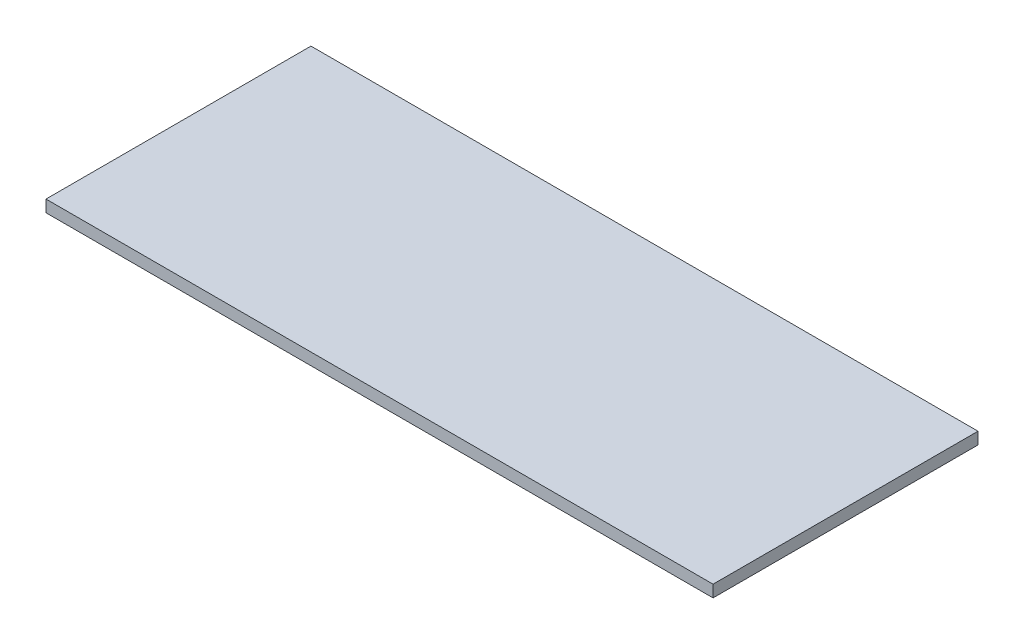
ISO-10303-21;
HEADER;
FILE_DESCRIPTION(('STEP AP214'),'2;1');
FILE_NAME('part.step','',(''),(''),'','','');
FILE_SCHEMA(('AUTOMOTIVE_DESIGN { 1 0 10303 214 1 1 1 1 }'));
ENDSEC;
DATA;
#1=APPLICATION_CONTEXT('core data for automotive mechanical design processes');
#2=APPLICATION_PROTOCOL_DEFINITION('international standard','automotive_design',2000,#1);
#3=PRODUCT_CONTEXT('',#1,'mechanical');
#4=PRODUCT('Part','Part','',(#3));
#5=PRODUCT_RELATED_PRODUCT_CATEGORY('part','',(#4));
#6=PRODUCT_DEFINITION_FORMATION('','',#4);
#7=PRODUCT_DEFINITION_CONTEXT('part definition',#1,'design');
#8=PRODUCT_DEFINITION('design','',#6,#7);
#9=PRODUCT_DEFINITION_SHAPE('','',#8);
#10=(LENGTH_UNIT() NAMED_UNIT(*) SI_UNIT(.MILLI.,.METRE.));
#11=(NAMED_UNIT(*) PLANE_ANGLE_UNIT() SI_UNIT($,.RADIAN.));
#12=(NAMED_UNIT(*) SI_UNIT($,.STERADIAN.) SOLID_ANGLE_UNIT());
#13=UNCERTAINTY_MEASURE_WITH_UNIT(LENGTH_MEASURE(1.E-05),#10,'distance_accuracy_value','');
#14=(GEOMETRIC_REPRESENTATION_CONTEXT(3) GLOBAL_UNCERTAINTY_ASSIGNED_CONTEXT((#13)) GLOBAL_UNIT_ASSIGNED_CONTEXT((#10,
#11,#12)) REPRESENTATION_CONTEXT('',''));
#15=CARTESIAN_POINT('',(0.,0.,0.));
#16=DIRECTION('',(0.,0.,1.));
#17=DIRECTION('',(1.,0.,0.));
#18=AXIS2_PLACEMENT_3D('',#15,#16,#17);
#19=CARTESIAN_POINT('',(-46.2,1.65,18.35));
#20=DIRECTION('',(0.,0.,-1.));
#21=DIRECTION('',(-1.,0.,0.));
#22=AXIS2_PLACEMENT_3D('',#19,#20,#21);
#23=PLANE('',#22);
#24=DIRECTION('',(1.,0.,0.));
#25=VECTOR('',#24,1.);
#26=CARTESIAN_POINT('',(-46.2,0.,18.35));
#27=LINE('',#26,#25);
#28=CARTESIAN_POINT('',(-46.2,0.,18.35));
#29=VERTEX_POINT('',#28);
#30=CARTESIAN_POINT('',(46.2,0.,18.35));
#31=VERTEX_POINT('',#30);
#32=EDGE_CURVE('E138',#29,#31,#27,.T.);
#33=ORIENTED_EDGE('',*,*,#32,.T.);
#34=DIRECTION('',(0.,-1.,0.));
#35=VECTOR('',#34,1.);
#36=CARTESIAN_POINT('',(46.2,1.65,18.35));
#37=LINE('',#36,#35);
#38=CARTESIAN_POINT('',(46.2,1.65,18.35));
#39=VERTEX_POINT('',#38);
#40=EDGE_CURVE('E197',#39,#31,#37,.T.);
#41=ORIENTED_EDGE('',*,*,#40,.F.);
#42=DIRECTION('',(1.,0.,0.));
#43=VECTOR('',#42,1.);
#44=CARTESIAN_POINT('',(-46.2,1.65,18.35));
#45=LINE('',#44,#43);
#46=CARTESIAN_POINT('',(-46.2,1.65,18.35));
#47=VERTEX_POINT('',#46);
#48=EDGE_CURVE('E134',#47,#39,#45,.T.);
#49=ORIENTED_EDGE('',*,*,#48,.F.);
#50=DIRECTION('',(0.,-1.,0.));
#51=VECTOR('',#50,1.);
#52=CARTESIAN_POINT('',(-46.2,1.65,18.35));
#53=LINE('',#52,#51);
#54=EDGE_CURVE('E147',#47,#29,#53,.T.);
#55=ORIENTED_EDGE('',*,*,#54,.T.);
#56=EDGE_LOOP('',(#33,#41,#49,#55));
#57=FACE_BOUND('',#56,.T.);
#58=ADVANCED_FACE('F39',(#57),#23,.F.);
#59=CARTESIAN_POINT('',(-44.0928203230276,-0.4,0.));
#60=DIRECTION('',(-0.258819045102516,0.965925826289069,0.));
#61=DIRECTION('',(0.,0.,1.));
#62=AXIS2_PLACEMENT_3D('',#59,#60,#61);
#63=PLANE('',#62);
#64=DIRECTION('',(-0.96592582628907,-0.258819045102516,0.));
#65=VECTOR('',#64,1.);
#66=CARTESIAN_POINT('',(-44.0928203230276,-0.4,-17.35));
#67=LINE('',#66,#65);
#68=CARTESIAN_POINT('',(-43.0911809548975,-0.131611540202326,-17.35));
#69=VERTEX_POINT('',#68);
#70=CARTESIAN_POINT('',(-42.7271665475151,-0.034074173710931,-17.35));
#71=VERTEX_POINT('',#70);
#72=EDGE_CURVE('E187',#69,#71,#67,.F.);
#73=ORIENTED_EDGE('',*,*,#72,.T.);
#74=DIRECTION('',(0.,0.,1.));
#75=VECTOR('',#74,1.);
#76=CARTESIAN_POINT('',(-42.7271665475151,-0.0340741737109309,0.));
#77=LINE('',#76,#75);
#78=CARTESIAN_POINT('',(-42.7271665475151,-0.034074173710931,17.35));
#79=VERTEX_POINT('',#78);
#80=EDGE_CURVE('E155',#71,#79,#77,.T.);
#81=ORIENTED_EDGE('',*,*,#80,.T.);
#82=DIRECTION('',(0.96592582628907,0.258819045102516,0.));
#83=VECTOR('',#82,1.);
#84=CARTESIAN_POINT('',(-44.0928203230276,-0.4,17.35));
#85=LINE('',#84,#83);
#86=CARTESIAN_POINT('',(-43.0911809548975,-0.131611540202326,17.35));
#87=VERTEX_POINT('',#86);
#88=EDGE_CURVE('E192',#79,#87,#85,.F.);
#89=ORIENTED_EDGE('',*,*,#88,.T.);
#90=DIRECTION('',(0.,0.,-1.));
#91=VECTOR('',#90,1.);
#92=CARTESIAN_POINT('',(-43.0911809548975,-0.131611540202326,0.));
#93=LINE('',#92,#91);
#94=EDGE_CURVE('E153',#87,#69,#93,.T.);
#95=ORIENTED_EDGE('',*,*,#94,.T.);
#96=EDGE_LOOP('',(#73,#81,#89,#95));
#97=FACE_BOUND('',#96,.T.);
#98=ADVANCED_FACE('F221',(#97),#63,.F.);
#99=CARTESIAN_POINT('',(-42.6071796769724,-0.4,0.));
#100=DIRECTION('',(0.258819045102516,0.96592582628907,0.));
#101=DIRECTION('',(0.,0.,-1.));
#102=AXIS2_PLACEMENT_3D('',#99,#100,#101);
#103=PLANE('',#102);
#104=DIRECTION('',(0.96592582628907,-0.258819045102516,0.));
#105=VECTOR('',#104,1.);
#106=CARTESIAN_POINT('',(-42.6071796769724,-0.399999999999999,17.35));
#107=LINE('',#106,#105);
#108=CARTESIAN_POINT('',(-43.6088190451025,-0.131611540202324,17.35));
#109=VERTEX_POINT('',#108);
#110=CARTESIAN_POINT('',(-43.9728334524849,-0.0340741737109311,17.35));
#111=VERTEX_POINT('',#110);
#112=EDGE_CURVE('E145',#109,#111,#107,.F.);
#113=ORIENTED_EDGE('',*,*,#112,.T.);
#114=DIRECTION('',(0.,0.,-1.));
#115=VECTOR('',#114,1.);
#116=CARTESIAN_POINT('',(-43.9728334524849,-0.034074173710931,0.));
#117=LINE('',#116,#115);
#118=CARTESIAN_POINT('',(-43.9728334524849,-0.0340741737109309,-17.35));
#119=VERTEX_POINT('',#118);
#120=EDGE_CURVE('E167',#111,#119,#117,.T.);
#121=ORIENTED_EDGE('',*,*,#120,.T.);
#122=DIRECTION('',(-0.96592582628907,0.258819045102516,0.));
#123=VECTOR('',#122,1.);
#124=CARTESIAN_POINT('',(-42.6071796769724,-0.400000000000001,-17.35));
#125=LINE('',#124,#123);
#126=CARTESIAN_POINT('',(-43.6088190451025,-0.131611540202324,-17.35));
#127=VERTEX_POINT('',#126);
#128=EDGE_CURVE('E143',#119,#127,#125,.F.);
#129=ORIENTED_EDGE('',*,*,#128,.T.);
#130=DIRECTION('',(0.,0.,-1.));
#131=VECTOR('',#130,1.);
#132=CARTESIAN_POINT('',(-43.6088190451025,-0.131611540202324,0.));
#133=LINE('',#132,#131);
#134=EDGE_CURVE('E164',#127,#109,#133,.F.);
#135=ORIENTED_EDGE('',*,*,#134,.T.);
#136=EDGE_LOOP('',(#113,#121,#129,#135));
#137=FACE_BOUND('',#136,.T.);
#138=ADVANCED_FACE('F225',(#137),#103,.F.);
#139=CARTESIAN_POINT('',(0.,0.,0.));
#140=DIRECTION('',(0.,1.,0.));
#141=DIRECTION('',(0.,0.,1.));
#142=AXIS2_PLACEMENT_3D('',#139,#140,#141);
#143=PLANE('',#142);
#144=DIRECTION('',(1.,0.,0.));
#145=VECTOR('',#144,1.);
#146=CARTESIAN_POINT('',(-46.2,0.,17.35));
#147=LINE('',#146,#145);
#148=CARTESIAN_POINT('',(-44.2316524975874,0.,17.35));
#149=VERTEX_POINT('',#148);
#150=CARTESIAN_POINT('',(-42.4683475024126,0.,17.35));
#151=VERTEX_POINT('',#150);
#152=EDGE_CURVE('E183',#149,#151,#147,.T.);
#153=ORIENTED_EDGE('',*,*,#152,.T.);
#154=DIRECTION('',(0.,0.,-1.));
#155=VECTOR('',#154,1.);
#156=CARTESIAN_POINT('',(-42.4683475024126,0.,0.));
#157=LINE('',#156,#155);
#158=CARTESIAN_POINT('',(-42.4683475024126,0.,-17.35));
#159=VERTEX_POINT('',#158);
#160=EDGE_CURVE('E161',#151,#159,#157,.T.);
#161=ORIENTED_EDGE('',*,*,#160,.T.);
#162=DIRECTION('',(-1.,0.,0.));
#163=VECTOR('',#162,1.);
#164=CARTESIAN_POINT('',(-46.2,0.,-17.35));
#165=LINE('',#164,#163);
#166=CARTESIAN_POINT('',(-44.2316524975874,0.,-17.35));
#167=VERTEX_POINT('',#166);
#168=EDGE_CURVE('E177',#159,#167,#165,.T.);
#169=ORIENTED_EDGE('',*,*,#168,.T.);
#170=DIRECTION('',(0.,0.,1.));
#171=VECTOR('',#170,1.);
#172=CARTESIAN_POINT('',(-44.2316524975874,0.,0.));
#173=LINE('',#172,#171);
#174=EDGE_CURVE('E158',#167,#149,#173,.T.);
#175=ORIENTED_EDGE('',*,*,#174,.T.);
#176=EDGE_LOOP('',(#153,#161,#169,#175));
#177=FACE_BOUND('',#176,.T.);
#178=DIRECTION('',(0.,0.,1.));
#179=VECTOR('',#178,1.);
#180=CARTESIAN_POINT('',(-46.2,0.,-18.35));
#181=LINE('',#180,#179);
#182=CARTESIAN_POINT('',(-46.2,0.,-18.35));
#183=VERTEX_POINT('',#182);
#184=EDGE_CURVE('E201',#183,#29,#181,.T.);
#185=ORIENTED_EDGE('',*,*,#184,.F.);
#186=DIRECTION('',(-1.,0.,0.));
#187=VECTOR('',#186,1.);
#188=CARTESIAN_POINT('',(-46.2,0.,-18.35));
#189=LINE('',#188,#187);
#190=CARTESIAN_POINT('',(46.2,0.,-18.35));
#191=VERTEX_POINT('',#190);
#192=EDGE_CURVE('E199',#191,#183,#189,.T.);
#193=ORIENTED_EDGE('',*,*,#192,.F.);
#194=DIRECTION('',(0.,0.,-1.));
#195=VECTOR('',#194,1.);
#196=CARTESIAN_POINT('',(46.2,0.,-18.35));
#197=LINE('',#196,#195);
#198=EDGE_CURVE('E142',#31,#191,#197,.T.);
#199=ORIENTED_EDGE('',*,*,#198,.F.);
#200=ORIENTED_EDGE('',*,*,#32,.F.);
#201=EDGE_LOOP('',(#185,#193,#199,#200));
#202=FACE_BOUND('',#201,.T.);
#203=ADVANCED_FACE('F181',(#177,#202),#143,.F.);
#204=CARTESIAN_POINT('',(46.2,1.65,-18.35));
#205=DIRECTION('',(-1.,0.,0.));
#206=DIRECTION('',(0.,0.,1.));
#207=AXIS2_PLACEMENT_3D('',#204,#205,#206);
#208=PLANE('',#207);
#209=ORIENTED_EDGE('',*,*,#198,.T.);
#210=DIRECTION('',(0.,-1.,0.));
#211=VECTOR('',#210,1.);
#212=CARTESIAN_POINT('',(46.2,1.65,-18.35));
#213=LINE('',#212,#211);
#214=CARTESIAN_POINT('',(46.2,1.65,-18.35));
#215=VERTEX_POINT('',#214);
#216=EDGE_CURVE('E122',#215,#191,#213,.T.);
#217=ORIENTED_EDGE('',*,*,#216,.F.);
#218=DIRECTION('',(0.,0.,-1.));
#219=VECTOR('',#218,1.);
#220=CARTESIAN_POINT('',(46.2,1.65,-18.35));
#221=LINE('',#220,#219);
#222=EDGE_CURVE('E129',#39,#215,#221,.T.);
#223=ORIENTED_EDGE('',*,*,#222,.F.);
#224=ORIENTED_EDGE('',*,*,#40,.T.);
#225=EDGE_LOOP('',(#209,#217,#223,#224));
#226=FACE_BOUND('',#225,.T.);
#227=ADVANCED_FACE('F140',(#226),#208,.F.);
#228=CARTESIAN_POINT('',(-46.2,1.65,-18.35));
#229=DIRECTION('',(0.,0.,1.));
#230=DIRECTION('',(1.,0.,0.));
#231=AXIS2_PLACEMENT_3D('',#228,#229,#230);
#232=PLANE('',#231);
#233=ORIENTED_EDGE('',*,*,#192,.T.);
#234=DIRECTION('',(0.,-1.,0.));
#235=VECTOR('',#234,1.);
#236=CARTESIAN_POINT('',(-46.2,1.65,-18.35));
#237=LINE('',#236,#235);
#238=CARTESIAN_POINT('',(-46.2,1.65,-18.35));
#239=VERTEX_POINT('',#238);
#240=EDGE_CURVE('E125',#239,#183,#237,.T.);
#241=ORIENTED_EDGE('',*,*,#240,.F.);
#242=DIRECTION('',(-1.,0.,0.));
#243=VECTOR('',#242,1.);
#244=CARTESIAN_POINT('',(-46.2,1.65,-18.35));
#245=LINE('',#244,#243);
#246=EDGE_CURVE('E118',#215,#239,#245,.T.);
#247=ORIENTED_EDGE('',*,*,#246,.F.);
#248=ORIENTED_EDGE('',*,*,#216,.T.);
#249=EDGE_LOOP('',(#233,#241,#247,#248));
#250=FACE_BOUND('',#249,.T.);
#251=ADVANCED_FACE('F120',(#250),#232,.F.);
#252=CARTESIAN_POINT('',(-46.2,1.65,-18.35));
#253=DIRECTION('',(1.,0.,0.));
#254=DIRECTION('',(0.,0.,-1.));
#255=AXIS2_PLACEMENT_3D('',#252,#253,#254);
#256=PLANE('',#255);
#257=ORIENTED_EDGE('',*,*,#184,.T.);
#258=ORIENTED_EDGE('',*,*,#54,.F.);
#259=DIRECTION('',(0.,0.,1.));
#260=VECTOR('',#259,1.);
#261=CARTESIAN_POINT('',(-46.2,1.65,-18.35));
#262=LINE('',#261,#260);
#263=EDGE_CURVE('E128',#239,#47,#262,.T.);
#264=ORIENTED_EDGE('',*,*,#263,.F.);
#265=ORIENTED_EDGE('',*,*,#240,.T.);
#266=EDGE_LOOP('',(#257,#258,#264,#265));
#267=FACE_BOUND('',#266,.T.);
#268=ADVANCED_FACE('F210',(#267),#256,.F.);
#269=CARTESIAN_POINT('',(0.,1.65,0.));
#270=DIRECTION('',(0.,1.,0.));
#271=DIRECTION('',(0.,0.,1.));
#272=AXIS2_PLACEMENT_3D('',#269,#270,#271);
#273=PLANE('',#272);
#274=ORIENTED_EDGE('',*,*,#222,.T.);
#275=ORIENTED_EDGE('',*,*,#246,.T.);
#276=ORIENTED_EDGE('',*,*,#263,.T.);
#277=ORIENTED_EDGE('',*,*,#48,.T.);
#278=EDGE_LOOP('',(#274,#275,#276,#277));
#279=FACE_BOUND('',#278,.T.);
#280=ADVANCED_FACE('F132',(#279),#273,.T.);
#281=CARTESIAN_POINT('',(-46.2,-0.200961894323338,-17.35));
#282=DIRECTION('',(0.,0.,-1.));
#283=DIRECTION('',(-1.,0.,0.));
#284=AXIS2_PLACEMENT_3D('',#281,#282,#283);
#285=PLANE('',#284);
#286=ORIENTED_EDGE('',*,*,#72,.F.);
#287=CARTESIAN_POINT('',(-43.35,0.834314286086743,-17.35));
#288=DIRECTION('',(0.,0.,-1.));
#289=DIRECTION('',(-1.,0.,0.));
#290=AXIS2_PLACEMENT_3D('',#287,#288,#289);
#291=CIRCLE('',#290,1.);
#292=EDGE_CURVE('E54',#69,#127,#291,.T.);
#293=ORIENTED_EDGE('',*,*,#292,.T.);
#294=ORIENTED_EDGE('',*,*,#128,.F.);
#295=CARTESIAN_POINT('',(-44.2316524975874,-1.,-17.35));
#296=DIRECTION('',(0.,0.,-1.));
#297=DIRECTION('',(-1.,0.,0.));
#298=AXIS2_PLACEMENT_3D('',#295,#296,#297);
#299=CIRCLE('',#298,1.);
#300=EDGE_CURVE('E47',#119,#167,#299,.F.);
#301=ORIENTED_EDGE('',*,*,#300,.T.);
#302=ORIENTED_EDGE('',*,*,#168,.F.);
#303=CARTESIAN_POINT('',(-42.4683475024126,-1.,-17.35));
#304=DIRECTION('',(0.,0.,-1.));
#305=DIRECTION('',(-1.,0.,0.));
#306=AXIS2_PLACEMENT_3D('',#303,#304,#305);
#307=CIRCLE('',#306,1.);
#308=EDGE_CURVE('E175',#159,#71,#307,.F.);
#309=ORIENTED_EDGE('',*,*,#308,.T.);
#310=EDGE_LOOP('',(#286,#293,#294,#301,#302,#309));
#311=FACE_BOUND('',#310,.T.);
#312=ADVANCED_FACE('F176',(#311),#285,.T.);
#313=CARTESIAN_POINT('',(-46.2,-0.200961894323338,17.35));
#314=DIRECTION('',(0.,0.,1.));
#315=DIRECTION('',(1.,0.,0.));
#316=AXIS2_PLACEMENT_3D('',#313,#314,#315);
#317=PLANE('',#316);
#318=ORIENTED_EDGE('',*,*,#112,.F.);
#319=CARTESIAN_POINT('',(-43.35,0.834314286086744,17.35));
#320=DIRECTION('',(0.,0.,1.));
#321=DIRECTION('',(1.,0.,0.));
#322=AXIS2_PLACEMENT_3D('',#319,#320,#321);
#323=CIRCLE('',#322,1.);
#324=EDGE_CURVE('E169',#109,#87,#323,.T.);
#325=ORIENTED_EDGE('',*,*,#324,.T.);
#326=ORIENTED_EDGE('',*,*,#88,.F.);
#327=CARTESIAN_POINT('',(-42.4683475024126,-1.,17.35));
#328=DIRECTION('',(0.,0.,1.));
#329=DIRECTION('',(1.,0.,0.));
#330=AXIS2_PLACEMENT_3D('',#327,#328,#329);
#331=CIRCLE('',#330,1.);
#332=EDGE_CURVE('E172',#79,#151,#331,.F.);
#333=ORIENTED_EDGE('',*,*,#332,.T.);
#334=ORIENTED_EDGE('',*,*,#152,.F.);
#335=CARTESIAN_POINT('',(-44.2316524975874,-1.,17.35));
#336=DIRECTION('',(0.,0.,1.));
#337=DIRECTION('',(1.,0.,0.));
#338=AXIS2_PLACEMENT_3D('',#335,#336,#337);
#339=CIRCLE('',#338,1.);
#340=EDGE_CURVE('E11',#149,#111,#339,.F.);
#341=ORIENTED_EDGE('',*,*,#340,.T.);
#342=EDGE_LOOP('',(#318,#325,#326,#333,#334,#341));
#343=FACE_BOUND('',#342,.T.);
#344=ADVANCED_FACE('F233',(#343),#317,.T.);
#345=CARTESIAN_POINT('',(-42.4683475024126,-1.,0.));
#346=DIRECTION('',(0.,0.,-1.));
#347=DIRECTION('',(-1.,0.,0.));
#348=AXIS2_PLACEMENT_3D('',#345,#346,#347);
#349=CYLINDRICAL_SURFACE('',#348,1.);
#350=ORIENTED_EDGE('',*,*,#308,.F.);
#351=ORIENTED_EDGE('',*,*,#160,.F.);
#352=ORIENTED_EDGE('',*,*,#332,.F.);
#353=ORIENTED_EDGE('',*,*,#80,.F.);
#354=EDGE_LOOP('',(#350,#351,#352,#353));
#355=FACE_BOUND('',#354,.T.);
#356=ADVANCED_FACE('F235',(#355),#349,.F.);
#357=CARTESIAN_POINT('',(-44.2316524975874,-1.,0.));
#358=DIRECTION('',(0.,0.,1.));
#359=DIRECTION('',(1.,0.,0.));
#360=AXIS2_PLACEMENT_3D('',#357,#358,#359);
#361=CYLINDRICAL_SURFACE('',#360,1.);
#362=ORIENTED_EDGE('',*,*,#340,.F.);
#363=ORIENTED_EDGE('',*,*,#174,.F.);
#364=ORIENTED_EDGE('',*,*,#300,.F.);
#365=ORIENTED_EDGE('',*,*,#120,.F.);
#366=EDGE_LOOP('',(#362,#363,#364,#365));
#367=FACE_BOUND('',#366,.T.);
#368=ADVANCED_FACE('F179',(#367),#361,.F.);
#369=CARTESIAN_POINT('',(-43.35,0.834314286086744,0.));
#370=DIRECTION('',(0.,0.,1.));
#371=DIRECTION('',(1.,0.,0.));
#372=AXIS2_PLACEMENT_3D('',#369,#370,#371);
#373=CYLINDRICAL_SURFACE('',#372,1.);
#374=ORIENTED_EDGE('',*,*,#292,.F.);
#375=ORIENTED_EDGE('',*,*,#94,.F.);
#376=ORIENTED_EDGE('',*,*,#324,.F.);
#377=ORIENTED_EDGE('',*,*,#134,.F.);
#378=EDGE_LOOP('',(#374,#375,#376,#377));
#379=FACE_BOUND('',#378,.T.);
#380=ADVANCED_FACE('F41',(#379),#373,.T.);
#381=CLOSED_SHELL('',(#58,#98,#138,#203,#227,#251,#268,#280,#312,#344,#356,#368,#380));
#382=MANIFOLD_SOLID_BREP('B2',#381);
#383=ADVANCED_BREP_SHAPE_REPRESENTATION('',(#18,#382),#14);
#384=SHAPE_DEFINITION_REPRESENTATION(#9,#383);
ENDSEC;
END-ISO-10303-21;
